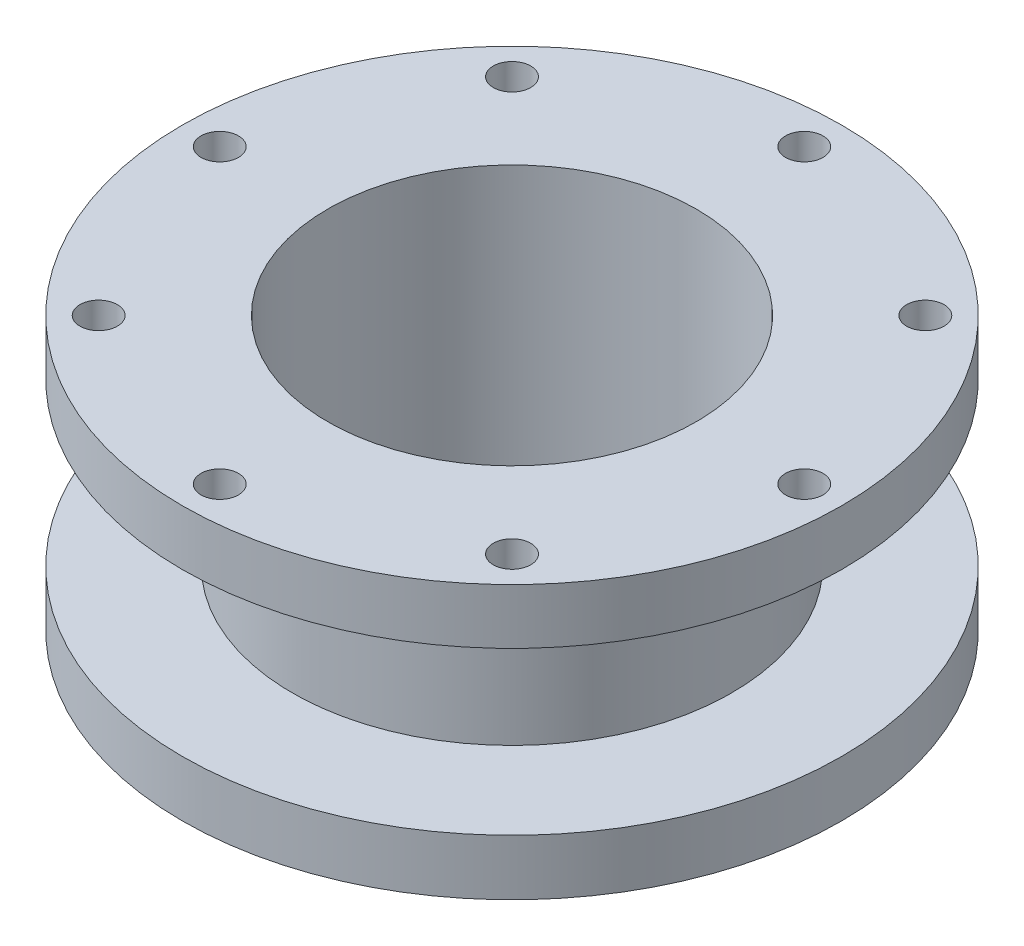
from build123d import *

# Parameters (mm, degrees)
R_P_TITION_CIRCULAIRE1_COUNT = 8


with BuildPart() as part:
    # Esquisse1 → R_volution1 (revolve)
    with BuildSketch(Plane.XY, mode=Mode.PRIVATE) as r_volution1_sk:
        Polygon((-32, 12.6), (-32, 60), (-57.25, 60), (-57.25, 50.4), (-38.15, 50.4), (-38.15, 22.3), (-57.25, 22.3), (-57.25, 12.6), align=None)
    revolve(r_volution1_sk.sketch.rotate(Axis((0, 0, 0), (0, 1, 0)), 270), axis=Axis((0, 0, 0), (0, 1, 0)))

    # Esquisse2 → Diam_tre du per_age _6.5 _6.5_1 (revolve, cut)
    with BuildSketch(Plane(origin=(0, 60, 50.75), x_dir=(0, 0, 1), z_dir=(1, 0, 0))):
        Polygon((0, 0), (0, 21.952797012), (3.25, 20), (3.25, 0), align=None)
    diam_tre_du_per_age_6_5_6_5_1 = revolve(axis=Axis((0, 66.35, 50.75), (0, -1, 0)), mode=Mode.SUBTRACT)

    # R_p_tition circulaire1: Diam_tre du per_age _6.5 _6.5_1 ×8 about axis
    r_p_tition_circulaire1_axis = Axis((0, 0, 0), (0, 1, 0))
    for i in range(1, R_P_TITION_CIRCULAIRE1_COUNT):
        add(diam_tre_du_per_age_6_5_6_5_1.rotate(r_p_tition_circulaire1_axis, i * 360 / R_P_TITION_CIRCULAIRE1_COUNT), mode=Mode.SUBTRACT)


solid = part.part
